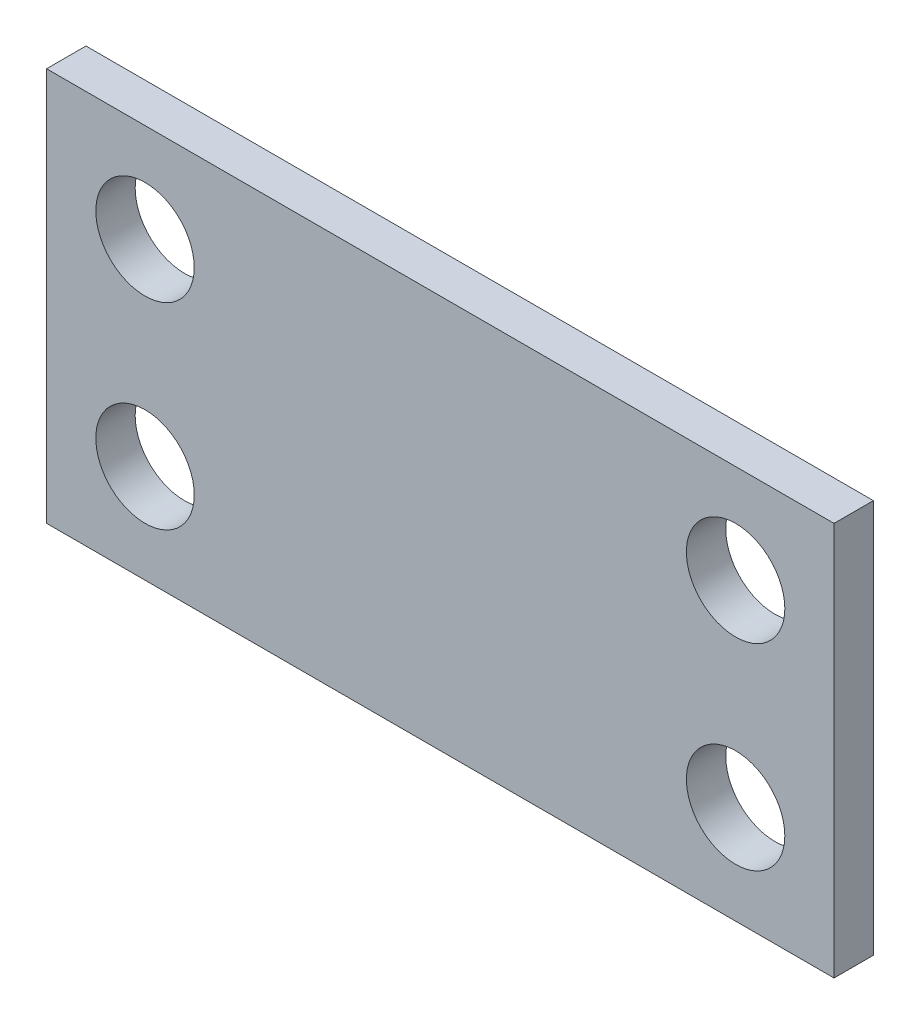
from build123d import *

# Parameters (mm, degrees)
SKETCH1_W          = 80
SKETCH1_H          = 40
EXTRUDE1_DEPTH     = 4
SKETCH2_R          = 5
CUT_EXTRUDE1_DEPTH = 10


with BuildPart() as part:
    # Sketch1 → Extrude1 (new body)
    with BuildSketch(Plane.XY):
        with Locations((40, 20)):
            Rectangle(SKETCH1_W, SKETCH1_H)
    extrude(amount=-EXTRUDE1_DEPTH)

    # Sketch2 → Cut-Extrude1 (cut)
    with BuildSketch(Plane.XY):
        with Locations((10, 30)):
            Circle(SKETCH2_R)
        with Locations((10, 10)):
            Circle(SKETCH2_R)
        with Locations((70, 10)):
            Circle(SKETCH2_R)
        with Locations((70, 30)):
            Circle(SKETCH2_R)
    extrude(amount=-CUT_EXTRUDE1_DEPTH, mode=Mode.SUBTRACT)


solid = part.part
